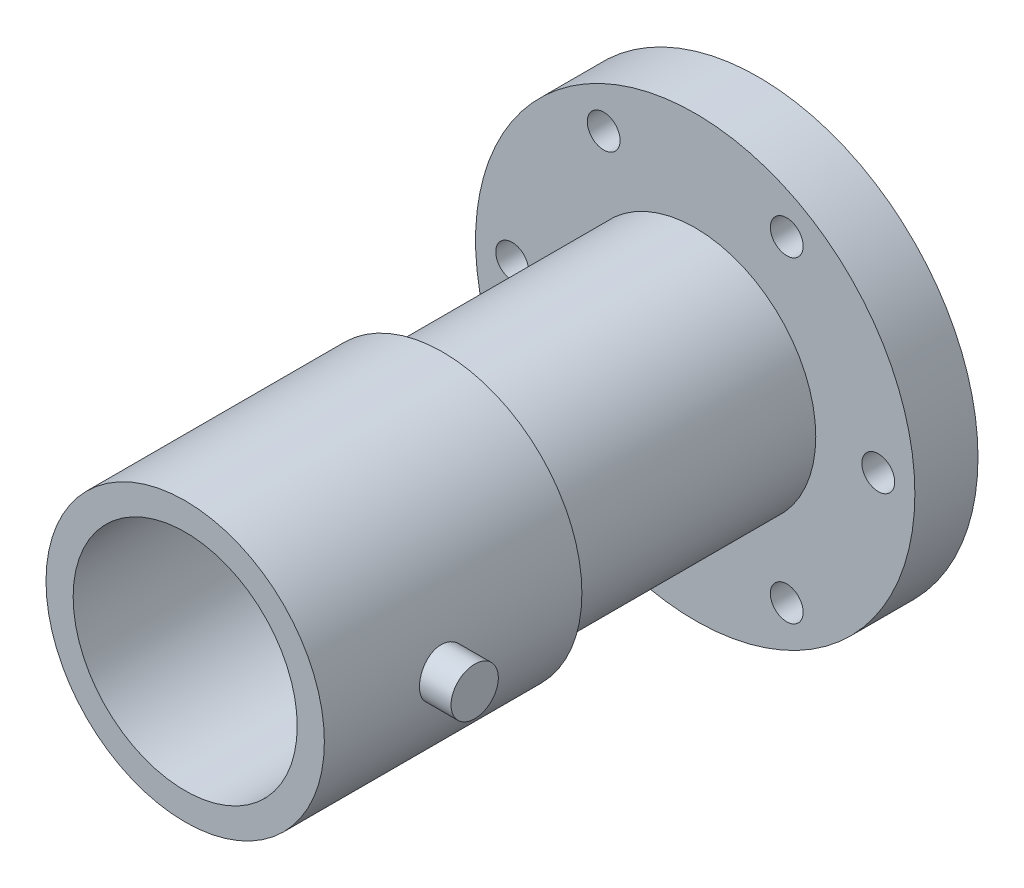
from build123d import *

# Parameters (mm, degrees)
SKETCH1_R                       = 44.196
EXTRUDE1_DEPTH                  = 12.7
SKETCH2_R                       = 24.257
EXTRUDE2_DEPTH                  = 50.8
SKETCH3_R                       = 28.0035
EXTRUDE3_DEPTH                  = 51.816
SKETCH7_R                       = 22.5425
CUT_EXTRUDE2_DEPTH              = 53.34
SKETCH8_R                       = 3.302
CUT_EXTRUDE3_DEPTH              = 132.165363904
CIRPATTERN4_COUNT               = 6
SKETCH9_R                       = 4.7625
EXTRUDE4_DEPTH                  = 6.35
EXTRUDE4_DIRECTION_2_REACH      = 145.052
EXTRUDE4_DIRECTION_2_END_RADIUS = 28.0035


with BuildPart() as part:
    # Sketch1 → Extrude1 (new body)
    with BuildSketch(Plane.XY):
        Circle(SKETCH1_R)
    extrude(amount=EXTRUDE1_DEPTH)

    # Sketch8 → Cut-Extrude3 (cut, through all)
    with BuildSketch(Plane(origin=(0, 0, 0), x_dir=(-1, 0, 0), z_dir=(0, 0, -1))):
        with Locations((-36.83, 0)):
            Circle(SKETCH8_R)
    cut_extrude3 = extrude(amount=-CUT_EXTRUDE3_DEPTH, mode=Mode.SUBTRACT)

    # CirPattern4: Cut-Extrude3 ×6 about axis
    cirpattern4_axis = Axis((0, 0, 0), (0, 0, 1))
    for i in range(1, CIRPATTERN4_COUNT):
        add(cut_extrude3.rotate(cirpattern4_axis, i * 360 / CIRPATTERN4_COUNT), mode=Mode.SUBTRACT)


with BuildPart() as body_2:
    # Sketch2 → Extrude2 (new body)
    with BuildSketch(Plane.XY.offset(12.7)):
        Circle(SKETCH2_R)
    extrude(amount=EXTRUDE2_DEPTH)


with BuildPart() as body_3:
    # Sketch3 → Extrude3 (new body)
    with BuildSketch(Plane.XY.offset(63.5)):
        Circle(SKETCH3_R)
    extrude(amount=EXTRUDE3_DEPTH)


with BuildPart() as cut_extrude2_tool:
    # Sketch7 → Cut-Extrude2 (new body)
    with BuildSketch(Plane.XY.offset(115.316)):
        Circle(SKETCH7_R)
    extrude(amount=-CUT_EXTRUDE2_DEPTH)


with BuildPart() as body_2_1:
    add(body_2.part)

    # Cut-Extrude2: cut by cut_extrude2_tool
    add(cut_extrude2_tool.part, mode=Mode.SUBTRACT)


with BuildPart() as body_3_1:
    add(body_3.part)

    # Cut-Extrude2: cut by cut_extrude2_tool
    add(cut_extrude2_tool.part, mode=Mode.SUBTRACT)

    # Sketch9 → Extrude4 (add)
    with BuildSketch(Plane(origin=(28.0035, 0, 0), x_dir=(0, 0, -1), z_dir=(1, 0, 0))):
        with Locations((-91.42222, 0)):
            Circle(SKETCH9_R)
    extrude(amount=EXTRUDE4_DEPTH)

    # Extrude4 direction 2: up to this cylinder (the profile starts outside it)
    extrude4_direction_2_end = Plane(origin=(0, 0, 91.42222), z_dir=(0, 0, -1)) * Cylinder(EXTRUDE4_DIRECTION_2_END_RADIUS, 347.111, mode=Mode.PRIVATE)
    # Sketch9 → Extrude4 direction 2 (add, up to the surface)
    with BuildSketch(Plane(origin=(28.0035, 0, 0), x_dir=(0, 0, -1), z_dir=(1, 0, 0)), mode=Mode.PRIVATE) as extrude4_direction_2_sk1:
        with Locations((-91.42222, 0)):
            Circle(SKETCH9_R)
    extrude4_direction_2_tool1 = extrude(extrude4_direction_2_sk1.sketch, amount=-EXTRUDE4_DIRECTION_2_REACH, mode=Mode.PRIVATE) - extrude4_direction_2_end
    add(extrude4_direction_2_tool1.solids().sort_by_distance((28.0035, 0, 91.42222))[0])
    add(extrude4_direction_2_tool1.solids().sort_by_distance((28.0035, 0, 91.42222))[1])


solid = Compound([part.part, body_2_1.part, body_3_1.part])
